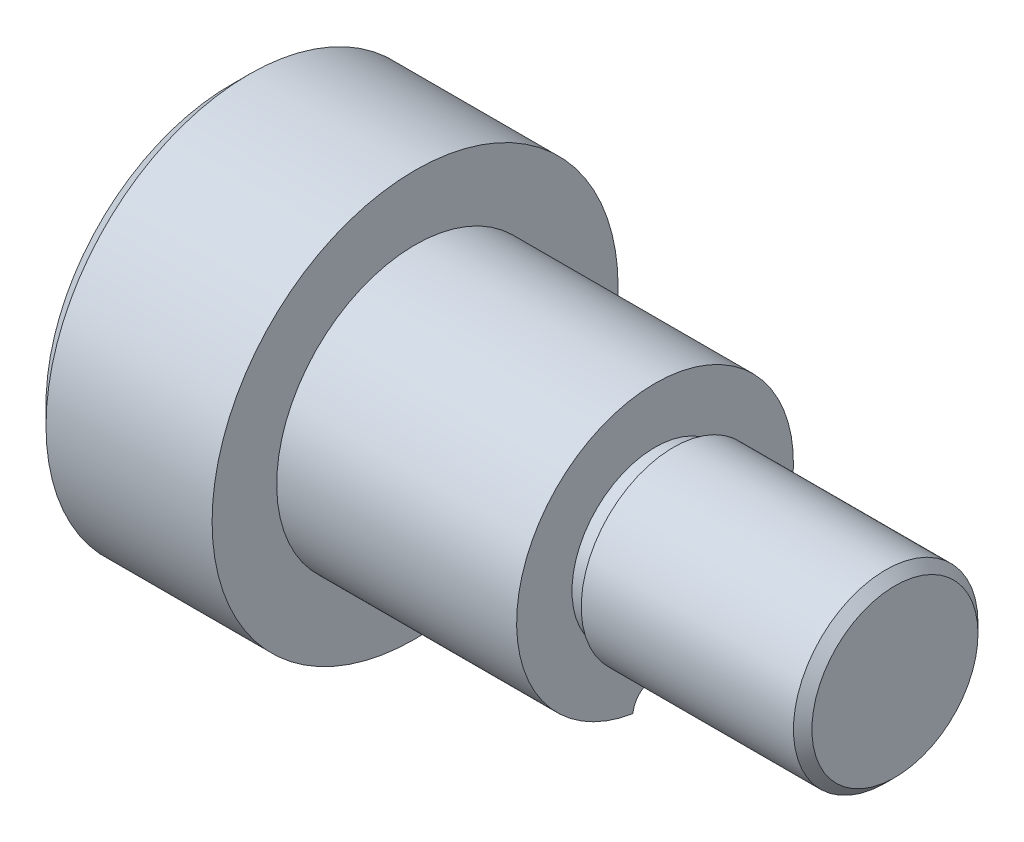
ISO-10303-21;
HEADER;
FILE_DESCRIPTION(('STEP AP214'),'2;1');
FILE_NAME('part.step','',(''),(''),'','','');
FILE_SCHEMA(('AUTOMOTIVE_DESIGN { 1 0 10303 214 1 1 1 1 }'));
ENDSEC;
DATA;
#1=APPLICATION_CONTEXT('core data for automotive mechanical design processes');
#2=APPLICATION_PROTOCOL_DEFINITION('international standard','automotive_design',2000,#1);
#3=PRODUCT_CONTEXT('',#1,'mechanical');
#4=PRODUCT('Part','Part','',(#3));
#5=PRODUCT_RELATED_PRODUCT_CATEGORY('part','',(#4));
#6=PRODUCT_DEFINITION_FORMATION('','',#4);
#7=PRODUCT_DEFINITION_CONTEXT('part definition',#1,'design');
#8=PRODUCT_DEFINITION('design','',#6,#7);
#9=PRODUCT_DEFINITION_SHAPE('','',#8);
#10=(LENGTH_UNIT() NAMED_UNIT(*) SI_UNIT(.MILLI.,.METRE.));
#11=(NAMED_UNIT(*) PLANE_ANGLE_UNIT() SI_UNIT($,.RADIAN.));
#12=(NAMED_UNIT(*) SI_UNIT($,.STERADIAN.) SOLID_ANGLE_UNIT());
#13=UNCERTAINTY_MEASURE_WITH_UNIT(LENGTH_MEASURE(1.E-05),#10,'distance_accuracy_value','');
#14=(GEOMETRIC_REPRESENTATION_CONTEXT(3) GLOBAL_UNCERTAINTY_ASSIGNED_CONTEXT((#13)) GLOBAL_UNIT_ASSIGNED_CONTEXT((#10,
#11,#12)) REPRESENTATION_CONTEXT('',''));
#15=CARTESIAN_POINT('',(0.,0.,0.));
#16=DIRECTION('',(0.,0.,1.));
#17=DIRECTION('',(1.,0.,0.));
#18=AXIS2_PLACEMENT_3D('',#15,#16,#17);
#19=CARTESIAN_POINT('',(23.,0.,0.));
#20=DIRECTION('',(1.,0.,0.));
#21=DIRECTION('',(0.,0.,-1.));
#22=AXIS2_PLACEMENT_3D('',#19,#20,#21);
#23=PLANE('',#22);
#24=CARTESIAN_POINT('',(23.,-7.50000000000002,0.));
#25=DIRECTION('',(1.,0.,0.));
#26=DIRECTION('',(0.,0.,-1.));
#27=AXIS2_PLACEMENT_3D('',#24,#25,#26);
#28=CIRCLE('',#27,1.19999999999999);
#29=CARTESIAN_POINT('',(23.,-7.40400000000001,-1.1961538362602));
#30=VERTEX_POINT('',#29);
#31=CARTESIAN_POINT('',(23.,-7.40400000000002,1.19615383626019));
#32=VERTEX_POINT('',#31);
#33=EDGE_CURVE('E57',#30,#32,#28,.T.);
#34=ORIENTED_EDGE('',*,*,#33,.F.);
#35=CARTESIAN_POINT('',(23.,0.,0.));
#36=DIRECTION('',(1.,0.,0.));
#37=DIRECTION('',(0.,0.,-1.));
#38=AXIS2_PLACEMENT_3D('',#35,#36,#37);
#39=CIRCLE('',#38,7.5);
#40=EDGE_CURVE('E77',#30,#32,#39,.T.);
#41=ORIENTED_EDGE('',*,*,#40,.T.);
#42=EDGE_LOOP('',(#34,#41));
#43=FACE_BOUND('',#42,.T.);
#44=CARTESIAN_POINT('',(23.,0.,0.));
#45=DIRECTION('',(1.,0.,0.));
#46=DIRECTION('',(0.,0.,-1.));
#47=AXIS2_PLACEMENT_3D('',#44,#45,#46);
#48=CIRCLE('',#47,4.5);
#49=CARTESIAN_POINT('',(23.,0.,-4.50000000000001));
#50=VERTEX_POINT('',#49);
#51=EDGE_CURVE('E129',#50,#50,#48,.T.);
#52=ORIENTED_EDGE('',*,*,#51,.F.);
#53=EDGE_LOOP('',(#52));
#54=FACE_BOUND('',#53,.T.);
#55=ADVANCED_FACE('F34',(#43,#54),#23,.T.);
#56=CARTESIAN_POINT('',(9.99999999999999,0.,0.));
#57=DIRECTION('',(1.,0.,0.));
#58=DIRECTION('',(0.,0.,-1.));
#59=AXIS2_PLACEMENT_3D('',#56,#57,#58);
#60=PLANE('',#59);
#61=CARTESIAN_POINT('',(9.99999999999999,0.,0.));
#62=DIRECTION('',(1.,0.,0.));
#63=DIRECTION('',(0.,0.,-1.));
#64=AXIS2_PLACEMENT_3D('',#61,#62,#63);
#65=CIRCLE('',#64,11.);
#66=CARTESIAN_POINT('',(9.99999999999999,0.,-11.));
#67=VERTEX_POINT('',#66);
#68=EDGE_CURVE('E144',#67,#67,#65,.T.);
#69=ORIENTED_EDGE('',*,*,#68,.T.);
#70=EDGE_LOOP('',(#69));
#71=FACE_BOUND('',#70,.T.);
#72=CARTESIAN_POINT('',(9.99999999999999,0.,0.));
#73=DIRECTION('',(1.,0.,0.));
#74=DIRECTION('',(0.,0.,-1.));
#75=AXIS2_PLACEMENT_3D('',#72,#73,#74);
#76=CIRCLE('',#75,7.5);
#77=CARTESIAN_POINT('',(9.99999999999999,0.,-7.50000000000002));
#78=VERTEX_POINT('',#77);
#79=EDGE_CURVE('E135',#78,#78,#76,.T.);
#80=ORIENTED_EDGE('',*,*,#79,.F.);
#81=EDGE_LOOP('',(#80));
#82=FACE_BOUND('',#81,.T.);
#83=ADVANCED_FACE('F121',(#71,#82),#60,.T.);
#84=CARTESIAN_POINT('',(9.99999999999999,0.,0.));
#85=DIRECTION('',(-1.,0.,0.));
#86=DIRECTION('',(0.,0.,1.));
#87=AXIS2_PLACEMENT_3D('',#84,#85,#86);
#88=CYLINDRICAL_SURFACE('',#87,11.);
#89=CARTESIAN_POINT('',(1.,0.,0.));
#90=DIRECTION('',(1.,0.,0.));
#91=DIRECTION('',(0.,0.,-1.));
#92=AXIS2_PLACEMENT_3D('',#89,#90,#91);
#93=CIRCLE('',#92,11.);
#94=CARTESIAN_POINT('',(1.,0.,-11.));
#95=VERTEX_POINT('',#94);
#96=EDGE_CURVE('E153',#95,#95,#93,.T.);
#97=ORIENTED_EDGE('',*,*,#96,.T.);
#98=EDGE_LOOP('',(#97));
#99=FACE_BOUND('',#98,.T.);
#100=ORIENTED_EDGE('',*,*,#68,.F.);
#101=EDGE_LOOP('',(#100));
#102=FACE_BOUND('',#101,.T.);
#103=ADVANCED_FACE('F36',(#99,#102),#88,.T.);
#104=CARTESIAN_POINT('',(0.,0.,0.));
#105=DIRECTION('',(1.,0.,0.));
#106=DIRECTION('',(0.,0.,-1.));
#107=AXIS2_PLACEMENT_3D('',#104,#105,#106);
#108=PLANE('',#107);
#109=CARTESIAN_POINT('',(0.,0.,0.));
#110=DIRECTION('',(1.,0.,0.));
#111=DIRECTION('',(0.,0.,-1.));
#112=AXIS2_PLACEMENT_3D('',#109,#110,#111);
#113=CIRCLE('',#112,9.99999999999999);
#114=CARTESIAN_POINT('',(0.,0.,-10.));
#115=VERTEX_POINT('',#114);
#116=EDGE_CURVE('E69',#115,#115,#113,.F.);
#117=ORIENTED_EDGE('',*,*,#116,.T.);
#118=EDGE_LOOP('',(#117));
#119=FACE_BOUND('',#118,.T.);
#120=ADVANCED_FACE('F158',(#119),#108,.F.);
#121=CARTESIAN_POINT('',(23.,0.,0.));
#122=DIRECTION('',(-1.,0.,0.));
#123=DIRECTION('',(0.,0.,1.));
#124=AXIS2_PLACEMENT_3D('',#121,#122,#123);
#125=CYLINDRICAL_SURFACE('',#124,7.5);
#126=CARTESIAN_POINT('',(16.2789672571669,-7.50000000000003,0.));
#127=CARTESIAN_POINT('',(16.2789710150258,-7.50000000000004,6.25412740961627E-06));
#128=CARTESIAN_POINT('',(16.2789747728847,-7.49999999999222,1.25082548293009E-05));
#129=CARTESIAN_POINT('',(16.2790128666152,-7.49999999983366,7.59068689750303E-05));
#130=CARTESIAN_POINT('',(16.2790472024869,-7.49999999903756,0.000133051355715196));
#131=CARTESIAN_POINT('',(16.2792188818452,-7.49999999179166,0.00041877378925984));
#132=CARTESIAN_POINT('',(16.2793562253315,-7.4999999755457,0.000647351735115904));
#133=CARTESIAN_POINT('',(16.2800429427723,-7.49999984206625,0.00179024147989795));
#134=CARTESIAN_POINT('',(16.2805923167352,-7.49999956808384,0.00270455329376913));
#135=CARTESIAN_POINT('',(16.2833391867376,-7.4999973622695,0.00727611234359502));
#136=CARTESIAN_POINT('',(16.2855366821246,-7.49999292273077,0.0109333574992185));
#137=CARTESIAN_POINT('',(16.2965241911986,-7.49995734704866,0.0292196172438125));
#138=CARTESIAN_POINT('',(16.3053142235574,-7.49988607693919,0.0438486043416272));
#139=CARTESIAN_POINT('',(16.3492656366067,-7.49931579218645,0.116994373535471));
#140=CARTESIAN_POINT('',(16.3844257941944,-7.49817497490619,0.175505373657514));
#141=CARTESIAN_POINT('',(16.5603379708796,-7.48903782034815,0.468165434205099));
#142=CARTESIAN_POINT('',(16.7011045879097,-7.47074225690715,0.702097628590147));
#143=CARTESIAN_POINT('',(16.9621094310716,-7.4165037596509,1.13393863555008));
#144=CARTESIAN_POINT('',(17.0823944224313,-7.3834703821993,1.33219905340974));
#145=CARTESIAN_POINT('',(17.3226324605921,-7.30153111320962,1.72569745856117));
#146=CARTESIAN_POINT('',(17.4425854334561,-7.25262193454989,1.92093481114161));
#147=CARTESIAN_POINT('',(17.6823714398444,-7.13897617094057,2.30776526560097));
#148=CARTESIAN_POINT('',(17.8022027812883,-7.07418805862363,2.49934426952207));
#149=CARTESIAN_POINT('',(18.0411847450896,-6.92920987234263,2.87697848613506));
#150=CARTESIAN_POINT('',(18.1603354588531,-6.8490219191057,3.0630344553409));
#151=CARTESIAN_POINT('',(18.2790805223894,-6.76129601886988,3.24574739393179));
#152=B_SPLINE_CURVE_WITH_KNOTS('',3,(#126,#127,#128,#129,#130,#131,#132,#133,#134,#135,#136,
#137,#138,#139,#140,#141,#142,#143,#144,#145,#146,#147,#148,#149,#150,#151),.UNSPECIFIED.,.F.,
.F.,(4,2,2,2,2,2,2,2,2,2,2,2,4),(0.,2.18888217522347E-05,0.000221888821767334,
0.00102188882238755,0.00422188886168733,0.0170218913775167,0.0682220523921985,0.27303235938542,
1.0928941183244,1.79509096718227,2.49743330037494,3.20208564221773,3.90664101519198),.UNSPECIFIED.);
#153=CARTESIAN_POINT('',(16.2789672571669,-7.50000000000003,0.));
#154=VERTEX_POINT('',#153);
#155=CARTESIAN_POINT('',(17.,-7.40400000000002,1.19615383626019));
#156=VERTEX_POINT('',#155);
#157=EDGE_CURVE('E49',#154,#156,#152,.T.);
#158=ORIENTED_EDGE('',*,*,#157,.T.);
#159=DIRECTION('',(1.,0.,0.));
#160=VECTOR('',#159,1.);
#161=CARTESIAN_POINT('',(20.,-7.40400000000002,1.19615383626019));
#162=LINE('',#161,#160);
#163=EDGE_CURVE('E11',#156,#32,#162,.T.);
#164=ORIENTED_EDGE('',*,*,#163,.T.);
#165=ORIENTED_EDGE('',*,*,#40,.F.);
#166=DIRECTION('',(1.,0.,0.));
#167=VECTOR('',#166,1.);
#168=CARTESIAN_POINT('',(20.,-7.40400000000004,-1.19615383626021));
#169=LINE('',#168,#167);
#170=CARTESIAN_POINT('',(17.,-7.40400000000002,-1.19615383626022));
#171=VERTEX_POINT('',#170);
#172=EDGE_CURVE('E42',#30,#171,#169,.F.);
#173=ORIENTED_EDGE('',*,*,#172,.T.);
#174=CARTESIAN_POINT('',(16.2789672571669,-7.50000000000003,0.));
#175=CARTESIAN_POINT('',(16.2789710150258,-7.50000000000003,-6.25412741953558E-06));
#176=CARTESIAN_POINT('',(16.2789747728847,-7.4999999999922,-1.25082548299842E-05));
#177=CARTESIAN_POINT('',(16.2790128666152,-7.49999999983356,-7.59068689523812E-05));
#178=CARTESIAN_POINT('',(16.2790472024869,-7.49999999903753,-0.000133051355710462));
#179=CARTESIAN_POINT('',(16.2792188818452,-7.49999999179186,-0.000418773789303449));
#180=CARTESIAN_POINT('',(16.2793562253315,-7.49999997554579,-0.000647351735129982));
#181=CARTESIAN_POINT('',(16.2800429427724,-7.49999984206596,-0.00179024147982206));
#182=CARTESIAN_POINT('',(16.2805923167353,-7.49999956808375,-0.00270455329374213));
#183=CARTESIAN_POINT('',(16.2833391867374,-7.49999736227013,-0.00727611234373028));
#184=CARTESIAN_POINT('',(16.2855366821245,-7.49999292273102,-0.0109333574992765));
#185=CARTESIAN_POINT('',(16.2965241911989,-7.49995734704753,-0.0292196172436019));
#186=CARTESIAN_POINT('',(16.3053142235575,-7.4998860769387,-0.0438486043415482));
#187=CARTESIAN_POINT('',(16.3492656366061,-7.49931579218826,-0.116994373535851));
#188=CARTESIAN_POINT('',(16.3844257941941,-7.49817497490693,-0.175505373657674));
#189=CARTESIAN_POINT('',(16.5603379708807,-7.48903782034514,-0.468165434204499));
#190=CARTESIAN_POINT('',(16.70110458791,-7.47074225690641,-0.702097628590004));
#191=CARTESIAN_POINT('',(16.962109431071,-7.41650375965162,-1.13393863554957));
#192=CARTESIAN_POINT('',(17.0823944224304,-7.38347038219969,-1.33219905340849));
#193=CARTESIAN_POINT('',(17.3226324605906,-7.30153111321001,-1.72569745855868));
#194=CARTESIAN_POINT('',(17.4425854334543,-7.25262193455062,-1.92093481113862));
#195=CARTESIAN_POINT('',(17.6823714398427,-7.13897617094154,-2.30776526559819));
#196=CARTESIAN_POINT('',(17.802202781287,-7.07418805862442,-2.49934426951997));
#197=CARTESIAN_POINT('',(18.041184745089,-6.92920987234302,-2.87697848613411));
#198=CARTESIAN_POINT('',(18.1603354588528,-6.84902191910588,-3.06303445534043));
#199=CARTESIAN_POINT('',(18.2790805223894,-6.76129601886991,-3.24574739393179));
#200=B_SPLINE_CURVE_WITH_KNOTS('',3,(#174,#175,#176,#177,#178,#179,#180,#181,#182,#183,#184,
#185,#186,#187,#188,#189,#190,#191,#192,#193,#194,#195,#196,#197,#198,#199),.UNSPECIFIED.,.F.,
.F.,(4,2,2,2,2,2,2,2,2,2,2,2,4),(0.,2.18888217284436E-05,0.000221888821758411,
0.00102188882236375,0.00422188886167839,0.0170218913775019,0.0682220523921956,0.273032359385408,
1.09289411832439,1.79509096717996,2.49743330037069,3.20208564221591,3.90664101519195),.UNSPECIFIED.);
#201=EDGE_CURVE('E63',#171,#154,#200,.F.);
#202=ORIENTED_EDGE('',*,*,#201,.T.);
#203=EDGE_LOOP('',(#158,#164,#165,#173,#202));
#204=FACE_BOUND('',#203,.T.);
#205=ORIENTED_EDGE('',*,*,#79,.T.);
#206=EDGE_LOOP('',(#205));
#207=FACE_BOUND('',#206,.T.);
#208=ADVANCED_FACE('F74',(#204,#207),#125,.T.);
#209=CARTESIAN_POINT('',(24.,0.,0.));
#210=DIRECTION('',(-1.,0.,0.));
#211=DIRECTION('',(0.,0.,1.));
#212=AXIS2_PLACEMENT_3D('',#209,#210,#211);
#213=CYLINDRICAL_SURFACE('',#212,4.5);
#214=CARTESIAN_POINT('',(24.,0.,0.));
#215=DIRECTION('',(1.,0.,0.));
#216=DIRECTION('',(0.,0.,-1.));
#217=AXIS2_PLACEMENT_3D('',#214,#215,#216);
#218=CIRCLE('',#217,4.5);
#219=CARTESIAN_POINT('',(24.,0.,-4.50000000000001));
#220=VERTEX_POINT('',#219);
#221=EDGE_CURVE('E131',#220,#220,#218,.T.);
#222=ORIENTED_EDGE('',*,*,#221,.F.);
#223=EDGE_LOOP('',(#222));
#224=FACE_BOUND('',#223,.T.);
#225=ORIENTED_EDGE('',*,*,#51,.T.);
#226=EDGE_LOOP('',(#225));
#227=FACE_BOUND('',#226,.T.);
#228=ADVANCED_FACE('F110',(#224,#227),#213,.T.);
#229=CARTESIAN_POINT('',(24.,0.,0.));
#230=DIRECTION('',(1.,0.,0.));
#231=DIRECTION('',(0.,0.,-1.));
#232=AXIS2_PLACEMENT_3D('',#229,#230,#231);
#233=PLANE('',#232);
#234=CARTESIAN_POINT('',(24.,0.,0.));
#235=DIRECTION('',(1.,0.,0.));
#236=DIRECTION('',(0.,0.,-1.));
#237=AXIS2_PLACEMENT_3D('',#234,#235,#236);
#238=CIRCLE('',#237,5.);
#239=CARTESIAN_POINT('',(24.,0.,-5.00000000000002));
#240=VERTEX_POINT('',#239);
#241=EDGE_CURVE('E132',#240,#240,#238,.T.);
#242=ORIENTED_EDGE('',*,*,#241,.F.);
#243=EDGE_LOOP('',(#242));
#244=FACE_BOUND('',#243,.T.);
#245=ORIENTED_EDGE('',*,*,#221,.T.);
#246=EDGE_LOOP('',(#245));
#247=FACE_BOUND('',#246,.T.);
#248=ADVANCED_FACE('F106',(#244,#247),#233,.F.);
#249=CARTESIAN_POINT('',(36.,0.,0.));
#250=DIRECTION('',(-1.,0.,0.));
#251=DIRECTION('',(0.,0.,1.));
#252=AXIS2_PLACEMENT_3D('',#249,#250,#251);
#253=CYLINDRICAL_SURFACE('',#252,5.);
#254=CARTESIAN_POINT('',(35.5,0.,0.));
#255=DIRECTION('',(1.,0.,0.));
#256=DIRECTION('',(0.,0.,-1.));
#257=AXIS2_PLACEMENT_3D('',#254,#255,#256);
#258=CIRCLE('',#257,5.);
#259=CARTESIAN_POINT('',(35.5,0.,-5.00000000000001));
#260=VERTEX_POINT('',#259);
#261=EDGE_CURVE('E150',#260,#260,#258,.F.);
#262=ORIENTED_EDGE('',*,*,#261,.T.);
#263=EDGE_LOOP('',(#262));
#264=FACE_BOUND('',#263,.T.);
#265=ORIENTED_EDGE('',*,*,#241,.T.);
#266=EDGE_LOOP('',(#265));
#267=FACE_BOUND('',#266,.T.);
#268=ADVANCED_FACE('F109',(#264,#267),#253,.T.);
#269=CARTESIAN_POINT('',(36.,0.,0.));
#270=DIRECTION('',(1.,0.,0.));
#271=DIRECTION('',(0.,0.,-1.));
#272=AXIS2_PLACEMENT_3D('',#269,#270,#271);
#273=PLANE('',#272);
#274=CARTESIAN_POINT('',(36.,0.,0.));
#275=DIRECTION('',(1.,0.,0.));
#276=DIRECTION('',(0.,0.,-1.));
#277=AXIS2_PLACEMENT_3D('',#274,#275,#276);
#278=CIRCLE('',#277,4.5);
#279=CARTESIAN_POINT('',(36.,0.,-4.5));
#280=VERTEX_POINT('',#279);
#281=EDGE_CURVE('E147',#280,#280,#278,.T.);
#282=ORIENTED_EDGE('',*,*,#281,.T.);
#283=EDGE_LOOP('',(#282));
#284=FACE_BOUND('',#283,.T.);
#285=ADVANCED_FACE('F104',(#284),#273,.T.);
#286=CARTESIAN_POINT('',(36.,0.,0.));
#287=DIRECTION('',(-1.,0.,0.));
#288=DIRECTION('',(0.,0.,1.));
#289=AXIS2_PLACEMENT_3D('',#286,#287,#288);
#290=CONICAL_SURFACE('',#289,4.5,0.785398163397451);
#291=ORIENTED_EDGE('',*,*,#261,.F.);
#292=EDGE_LOOP('',(#291));
#293=FACE_BOUND('',#292,.T.);
#294=ORIENTED_EDGE('',*,*,#281,.F.);
#295=EDGE_LOOP('',(#294));
#296=FACE_BOUND('',#295,.T.);
#297=ADVANCED_FACE('F100',(#293,#296),#290,.T.);
#298=CARTESIAN_POINT('',(1.,0.,0.));
#299=DIRECTION('',(1.,0.,0.));
#300=DIRECTION('',(0.,0.,-1.));
#301=AXIS2_PLACEMENT_3D('',#298,#299,#300);
#302=CONICAL_SURFACE('',#301,11.,0.785398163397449);
#303=ORIENTED_EDGE('',*,*,#116,.F.);
#304=EDGE_LOOP('',(#303));
#305=FACE_BOUND('',#304,.T.);
#306=ORIENTED_EDGE('',*,*,#96,.F.);
#307=EDGE_LOOP('',(#306));
#308=FACE_BOUND('',#307,.T.);
#309=ADVANCED_FACE('F97',(#305,#308),#302,.T.);
#310=CARTESIAN_POINT('',(23.,-7.50000000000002,0.));
#311=DIRECTION('',(1.,0.,0.));
#312=DIRECTION('',(0.,0.,-1.));
#313=AXIS2_PLACEMENT_3D('',#310,#311,#312);
#314=CYLINDRICAL_SURFACE('',#313,1.19999999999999);
#315=CARTESIAN_POINT('',(17.,-7.50000000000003,0.));
#316=DIRECTION('',(1.,0.,0.));
#317=DIRECTION('',(0.,0.,-1.));
#318=AXIS2_PLACEMENT_3D('',#315,#316,#317);
#319=CIRCLE('',#318,1.2);
#320=EDGE_CURVE('E66',#171,#156,#319,.T.);
#321=ORIENTED_EDGE('',*,*,#320,.F.);
#322=ORIENTED_EDGE('',*,*,#172,.F.);
#323=ORIENTED_EDGE('',*,*,#33,.T.);
#324=ORIENTED_EDGE('',*,*,#163,.F.);
#325=EDGE_LOOP('',(#321,#322,#323,#324));
#326=FACE_BOUND('',#325,.T.);
#327=ADVANCED_FACE('F71',(#326),#314,.F.);
#328=CARTESIAN_POINT('',(17.,-7.50000000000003,0.));
#329=DIRECTION('',(1.,0.,0.));
#330=DIRECTION('',(0.,0.,-1.));
#331=AXIS2_PLACEMENT_3D('',#328,#329,#330);
#332=CONICAL_SURFACE('',#331,1.2,1.02974425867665);
#333=ORIENTED_EDGE('',*,*,#201,.F.);
#334=ORIENTED_EDGE('',*,*,#320,.T.);
#335=ORIENTED_EDGE('',*,*,#157,.F.);
#336=EDGE_LOOP('',(#333,#334,#335));
#337=FACE_BOUND('',#336,.T.);
#338=ADVANCED_FACE('F65',(#337),#332,.F.);
#339=CLOSED_SHELL('',(#55,#83,#103,#120,#208,#228,#248,#268,#285,#297,#309,#327,#338));
#340=MANIFOLD_SOLID_BREP('B2',#339);
#341=ADVANCED_BREP_SHAPE_REPRESENTATION('',(#18,#340),#14);
#342=SHAPE_DEFINITION_REPRESENTATION(#9,#341);
ENDSEC;
END-ISO-10303-21;
